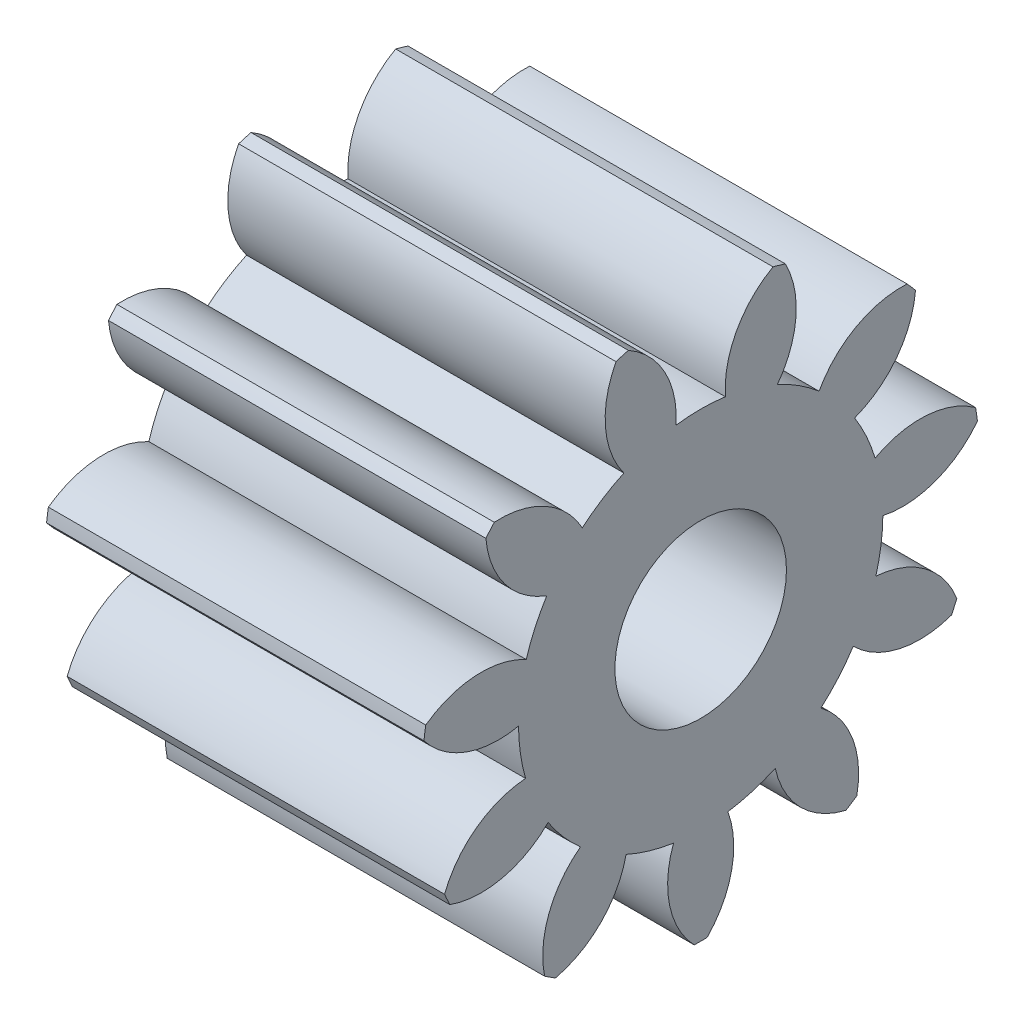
from build123d import *
from build123d.topology import SkipClean

# Parameters (mm, degrees)
BASPROSKE_W      = 4.1
BASPROSKE_H      = 3.25
TOOTHCUT_DEPTH   = 7.15913955
TEETHCUTS_COUNT  = 11
BORSKE_R         = 1
BORE_DEPTH       = 50.0000508
ESQUISSE1_R      = 1
EXTRUSION1_DEPTH = 0.3


with BuildPart() as part:
    # BasProSke → Base-Revolve (revolve)
    with BuildSketch(Plane(origin=(0, 0, 0), x_dir=(1, 0, 0), z_dir=(0, 1, 0)), mode=Mode.PRIVATE) as base_revolve_sk:
        with Locations((2.05, 1.625)):
            Rectangle(BASPROSKE_W, BASPROSKE_H)
    revolve(base_revolve_sk.sketch.rotate(Axis((-10, 0, 0), (1, 0, 0)), 180), axis=Axis((-10, 0, 0), (1, 0, 0)))

    # TooCutSke → ToothCut (cut, through all)
    with BuildSketch(Plane(origin=(0, 0, 0), x_dir=(0, 0, -1), z_dir=(1, 0, 0))):
        with BuildLine():
            ThreePointArc((0.28805857, 2.104375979), (0, 2.124), (-0.28805857, 2.104375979))
            ThreePointArc((-0.28805857, 2.104375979), (-0.425029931, 2.717876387), (-0.875610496, 3.156192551))
            ThreePointArc((-0.875610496, 3.156192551), (0, 3.2754), (0.875610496, 3.156192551))
            ThreePointArc((0.875610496, 3.156192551), (0.425029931, 2.717876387), (0.28805857, 2.104375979))
        make_face()
    toothcut = extrude(amount=TOOTHCUT_DEPTH, mode=Mode.SUBTRACT)

    # TeethCuts: ToothCut ×11 about axis
    teethcuts_axis = Axis((0, 0, 0), (1, 0, 0))
    for i in range(1, TEETHCUTS_COUNT):
        add(toothcut.rotate(teethcuts_axis, i * 360 / TEETHCUTS_COUNT), mode=Mode.SUBTRACT)

    # BorSke → Bore (cut, symmetric)
    with BuildSketch(Plane(origin=(0, 0, 0), x_dir=(0, 0, -1), z_dir=(1, 0, 0))):
        with Locations(Location((0, 0, 0), (0, 0, 180))):
            Circle(BORSKE_R)
    extrude(amount=BORE_DEPTH, both=True, mode=Mode.SUBTRACT)

    # Esquisse1 → Extrusion1 (add)
    with SkipClean():  # the faces are left unmerged after this step: merging them gives an invalid solid
        with BuildSketch(Plane(origin=(4.1, 0, 0), x_dir=(0, 0, -1), z_dir=(1, 0, 0))):
            with BuildLine():
                ThreePointArc((2.406400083, 2.184430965), (1.810847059, 2.047867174), (1.380041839, 1.614577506))
                ThreePointArc((1.380041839, 1.614577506), (1.148321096, 1.786822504), (0.89538126, 1.926049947))
                ThreePointArc((0.89538126, 1.926049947), (1.11055245, 2.497919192), (0.987373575, 3.096383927))
                ThreePointArc((0.987373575, 3.096383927), (0.91563081, 3.118352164), (0.843400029, 3.138658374))
                ThreePointArc((0.843400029, 3.138658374), (0.416220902, 2.701793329), (0.28805857, 2.104375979))
                ThreePointArc((0.28805857, 2.104375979), (0, 2.124), (-0.28805857, 2.104375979))
                ThreePointArc((-0.28805857, 2.104375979), (-0.416220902, 2.701793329), (-0.843400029, 3.138658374))
                ThreePointArc((-0.843400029, 3.138658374), (-0.91563081, 3.118352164), (-0.987373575, 3.096383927))
                ThreePointArc((-0.987373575, 3.096383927), (-1.11055245, 2.497919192), (-0.89538126, 1.926049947))
                ThreePointArc((-0.89538126, 1.926049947), (-1.148321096, 1.786822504), (-1.380041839, 1.614577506))
                ThreePointArc((-1.380041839, 1.614577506), (-1.810847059, 2.047867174), (-2.406400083, 2.184430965))
                ThreePointArc((-2.406400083, 2.184430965), (-2.456186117, 2.128297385), (-2.504663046, 2.071029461))
                ThreePointArc((-2.504663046, 2.071029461), (-2.284733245, 1.500973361), (-1.794543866, 1.136216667))
                ThreePointArc((-1.794543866, 1.136216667), (-1.932058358, 0.882341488), (-2.033871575, 0.612162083))
                ThreePointArc((-2.033871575, 0.612162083), (-2.630542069, 0.743757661), (-3.205385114, 0.536662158))
                ThreePointArc((-3.205385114, 0.536662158), (-3.216919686, 0.462523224), (-3.226739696, 0.388137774))
                ThreePointArc((-3.226739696, 0.388137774), (-2.733527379, 0.027479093), (-2.123951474, -0.014357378))
                ThreePointArc((-2.123951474, -0.014357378), (-2.102380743, -0.302276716), (-2.041961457, -0.584610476))
                ThreePointArc((-2.041961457, -0.584610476), (-2.615058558, -0.796489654), (-2.986683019, -1.281493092))
                ThreePointArc((-2.986683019, -1.281493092), (-2.956303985, -1.350098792), (-2.924349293, -1.417984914))
                ThreePointArc((-2.924349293, -1.417984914), (-2.314445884, -1.454739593), (-1.779019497, -1.160373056))
                ThreePointArc((-1.779019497, -1.160373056), (-1.605212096, -1.390924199), (-1.401743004, -1.59577334))
                ThreePointArc((-1.401743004, -1.59577334), (-1.769312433, -2.083857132), (-1.819730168, -2.69278334))
                ThreePointArc((-1.819730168, -2.69278334), (-1.757082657, -2.734073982), (-1.693498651, -2.77390741))
                ThreePointArc((-1.693498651, -2.77390741), (-1.160544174, -2.475088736), (-0.869261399, -1.937978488))
                ThreePointArc((-0.869261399, -1.937978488), (-0.598399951, -2.037963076), (-0.316481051, -2.100289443))
                ThreePointArc((-0.316481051, -2.100289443), (-0.361822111, -2.709614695), (-0.075025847, -3.249133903))
                ThreePointArc((-0.075025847, -3.249133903), (0, -3.25), (0.075025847, -3.249133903))
                ThreePointArc((0.075025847, -3.249133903), (0.361822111, -2.709614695), (0.316481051, -2.100289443))
                ThreePointArc((0.316481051, -2.100289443), (0.598399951, -2.037963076), (0.869261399, -1.937978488))
                ThreePointArc((0.869261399, -1.937978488), (1.160544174, -2.475088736), (1.693498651, -2.77390741))
                ThreePointArc((1.693498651, -2.77390741), (1.757082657, -2.734073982), (1.819730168, -2.69278334))
                ThreePointArc((1.819730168, -2.69278334), (1.769312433, -2.083857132), (1.401743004, -1.59577334))
                ThreePointArc((1.401743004, -1.59577334), (1.605212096, -1.390924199), (1.779019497, -1.160373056))
                ThreePointArc((1.779019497, -1.160373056), (2.314445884, -1.454739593), (2.924349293, -1.417984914))
                ThreePointArc((2.924349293, -1.417984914), (2.956303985, -1.350098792), (2.986683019, -1.281493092))
                ThreePointArc((2.986683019, -1.281493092), (2.615058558, -0.796489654), (2.041961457, -0.584610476))
                ThreePointArc((2.041961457, -0.584610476), (2.102380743, -0.302276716), (2.123951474, -0.014357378))
                ThreePointArc((2.123951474, -0.014357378), (2.733527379, 0.027479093), (3.226739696, 0.388137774))
                ThreePointArc((3.226739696, 0.388137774), (3.216919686, 0.462523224), (3.205385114, 0.536662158))
                ThreePointArc((3.205385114, 0.536662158), (2.630542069, 0.743757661), (2.033871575, 0.612162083))
                ThreePointArc((2.033871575, 0.612162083), (1.932058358, 0.882341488), (1.794543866, 1.136216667))
                ThreePointArc((1.794543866, 1.136216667), (2.284733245, 1.500973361), (2.504663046, 2.071029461))
                ThreePointArc((2.504663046, 2.071029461), (2.456186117, 2.128297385), (2.406400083, 2.184430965))
            make_face()
            Circle(ESQUISSE1_R, mode=Mode.SUBTRACT)
        extrude(amount=EXTRUSION1_DEPTH)


solid = part.part
